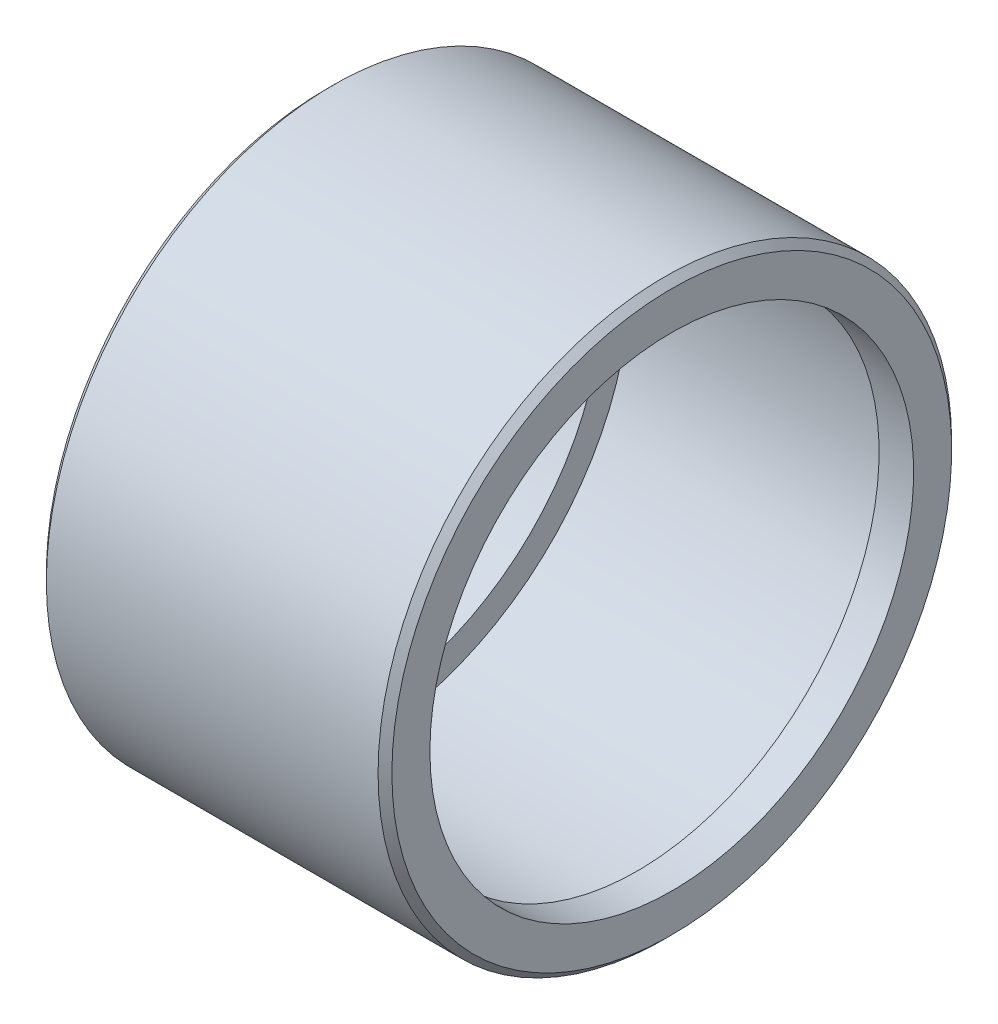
ISO-10303-21;
HEADER;
FILE_DESCRIPTION(('STEP AP214'),'2;1');
FILE_NAME('part.step','',(''),(''),'','','');
FILE_SCHEMA(('AUTOMOTIVE_DESIGN { 1 0 10303 214 1 1 1 1 }'));
ENDSEC;
DATA;
#1=APPLICATION_CONTEXT('core data for automotive mechanical design processes');
#2=APPLICATION_PROTOCOL_DEFINITION('international standard','automotive_design',2000,#1);
#3=PRODUCT_CONTEXT('',#1,'mechanical');
#4=PRODUCT('Part','Part','',(#3));
#5=PRODUCT_RELATED_PRODUCT_CATEGORY('part','',(#4));
#6=PRODUCT_DEFINITION_FORMATION('','',#4);
#7=PRODUCT_DEFINITION_CONTEXT('part definition',#1,'design');
#8=PRODUCT_DEFINITION('design','',#6,#7);
#9=PRODUCT_DEFINITION_SHAPE('','',#8);
#10=(LENGTH_UNIT() NAMED_UNIT(*) SI_UNIT(.MILLI.,.METRE.));
#11=(NAMED_UNIT(*) PLANE_ANGLE_UNIT() SI_UNIT($,.RADIAN.));
#12=(NAMED_UNIT(*) SI_UNIT($,.STERADIAN.) SOLID_ANGLE_UNIT());
#13=UNCERTAINTY_MEASURE_WITH_UNIT(LENGTH_MEASURE(1.E-05),#10,'distance_accuracy_value','');
#14=(GEOMETRIC_REPRESENTATION_CONTEXT(3) GLOBAL_UNCERTAINTY_ASSIGNED_CONTEXT((#13)) GLOBAL_UNIT_ASSIGNED_CONTEXT((#10,
#11,#12)) REPRESENTATION_CONTEXT('',''));
#15=CARTESIAN_POINT('',(0.,0.,0.));
#16=DIRECTION('',(0.,0.,1.));
#17=DIRECTION('',(1.,0.,0.));
#18=AXIS2_PLACEMENT_3D('',#15,#16,#17);
#19=CARTESIAN_POINT('',(-4.55642736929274,0.,0.));
#20=DIRECTION('',(-1.,0.,0.));
#21=DIRECTION('',(0.,0.,1.));
#22=AXIS2_PLACEMENT_3D('',#19,#20,#21);
#23=CYLINDRICAL_SURFACE('',#22,4.15);
#24=CARTESIAN_POINT('',(4.9,0.,0.));
#25=DIRECTION('',(-1.,0.,0.));
#26=DIRECTION('',(0.,0.,1.));
#27=AXIS2_PLACEMENT_3D('',#24,#25,#26);
#28=CIRCLE('',#27,4.15);
#29=CARTESIAN_POINT('',(4.9,0.,4.15));
#30=VERTEX_POINT('',#29);
#31=EDGE_CURVE('E360',#30,#30,#28,.T.);
#32=ORIENTED_EDGE('',*,*,#31,.T.);
#33=EDGE_LOOP('',(#32));
#34=FACE_BOUND('',#33,.T.);
#35=CARTESIAN_POINT('',(0.100000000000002,0.,0.));
#36=DIRECTION('',(1.,0.,0.));
#37=DIRECTION('',(0.,0.,-1.));
#38=AXIS2_PLACEMENT_3D('',#35,#36,#37);
#39=CIRCLE('',#38,4.15);
#40=CARTESIAN_POINT('',(0.100000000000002,0.,-4.15));
#41=VERTEX_POINT('',#40);
#42=EDGE_CURVE('E364',#41,#41,#39,.T.);
#43=ORIENTED_EDGE('',*,*,#42,.T.);
#44=EDGE_LOOP('',(#43));
#45=FACE_BOUND('',#44,.T.);
#46=ADVANCED_FACE('F350',(#34,#45),#23,.T.);
#47=CARTESIAN_POINT('',(5.,4.15,0.));
#48=DIRECTION('',(-1.,0.,0.));
#49=DIRECTION('',(0.,0.,1.));
#50=AXIS2_PLACEMENT_3D('',#47,#48,#49);
#51=PLANE('',#50);
#52=CARTESIAN_POINT('',(5.,0.,0.));
#53=DIRECTION('',(-1.,0.,0.));
#54=DIRECTION('',(0.,0.,1.));
#55=AXIS2_PLACEMENT_3D('',#52,#53,#54);
#56=CIRCLE('',#55,4.05);
#57=CARTESIAN_POINT('',(5.,0.,4.05));
#58=VERTEX_POINT('',#57);
#59=EDGE_CURVE('E356',#58,#58,#56,.F.);
#60=ORIENTED_EDGE('',*,*,#59,.T.);
#61=EDGE_LOOP('',(#60));
#62=FACE_BOUND('',#61,.T.);
#63=CARTESIAN_POINT('',(5.,0.,0.));
#64=DIRECTION('',(-1.,0.,0.));
#65=DIRECTION('',(0.,0.,1.));
#66=AXIS2_PLACEMENT_3D('',#63,#64,#65);
#67=CIRCLE('',#66,3.5);
#68=CARTESIAN_POINT('',(5.,0.,3.5));
#69=VERTEX_POINT('',#68);
#70=EDGE_CURVE('E369',#69,#69,#67,.T.);
#71=ORIENTED_EDGE('',*,*,#70,.T.);
#72=EDGE_LOOP('',(#71));
#73=FACE_BOUND('',#72,.T.);
#74=ADVANCED_FACE('F406',(#62,#73),#51,.F.);
#75=CARTESIAN_POINT('',(-4.55642736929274,0.,0.));
#76=DIRECTION('',(-1.,0.,0.));
#77=DIRECTION('',(0.,0.,1.));
#78=AXIS2_PLACEMENT_3D('',#75,#76,#77);
#79=CYLINDRICAL_SURFACE('',#78,3.5);
#80=ORIENTED_EDGE('',*,*,#70,.F.);
#81=EDGE_LOOP('',(#80));
#82=FACE_BOUND('',#81,.T.);
#83=CARTESIAN_POINT('',(4.5,0.,0.));
#84=DIRECTION('',(-1.,0.,0.));
#85=DIRECTION('',(0.,0.,1.));
#86=AXIS2_PLACEMENT_3D('',#83,#84,#85);
#87=CIRCLE('',#86,3.5);
#88=CARTESIAN_POINT('',(4.5,0.,3.5));
#89=VERTEX_POINT('',#88);
#90=EDGE_CURVE('E372',#89,#89,#87,.T.);
#91=ORIENTED_EDGE('',*,*,#90,.T.);
#92=EDGE_LOOP('',(#91));
#93=FACE_BOUND('',#92,.T.);
#94=ADVANCED_FACE('F410',(#82,#93),#79,.F.);
#95=CARTESIAN_POINT('',(4.5,3.9,0.));
#96=DIRECTION('',(1.,0.,0.));
#97=DIRECTION('',(0.,0.,-1.));
#98=AXIS2_PLACEMENT_3D('',#95,#96,#97);
#99=PLANE('',#98);
#100=ORIENTED_EDGE('',*,*,#90,.F.);
#101=EDGE_LOOP('',(#100));
#102=FACE_BOUND('',#101,.T.);
#103=CARTESIAN_POINT('',(4.5,0.,0.));
#104=DIRECTION('',(-1.,0.,0.));
#105=DIRECTION('',(0.,0.,1.));
#106=AXIS2_PLACEMENT_3D('',#103,#104,#105);
#107=CIRCLE('',#106,3.9);
#108=CARTESIAN_POINT('',(4.5,0.,3.9));
#109=VERTEX_POINT('',#108);
#110=EDGE_CURVE('E375',#109,#109,#107,.T.);
#111=ORIENTED_EDGE('',*,*,#110,.T.);
#112=EDGE_LOOP('',(#111));
#113=FACE_BOUND('',#112,.T.);
#114=ADVANCED_FACE('F445',(#102,#113),#99,.F.);
#115=CARTESIAN_POINT('',(-4.55642736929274,0.,0.));
#116=DIRECTION('',(-1.,0.,0.));
#117=DIRECTION('',(0.,0.,1.));
#118=AXIS2_PLACEMENT_3D('',#115,#116,#117);
#119=CYLINDRICAL_SURFACE('',#118,3.9);
#120=ORIENTED_EDGE('',*,*,#110,.F.);
#121=EDGE_LOOP('',(#120));
#122=FACE_BOUND('',#121,.T.);
#123=CARTESIAN_POINT('',(0.5,0.,0.));
#124=DIRECTION('',(-1.,0.,0.));
#125=DIRECTION('',(0.,0.,1.));
#126=AXIS2_PLACEMENT_3D('',#123,#124,#125);
#127=CIRCLE('',#126,3.9);
#128=CARTESIAN_POINT('',(0.5,0.,3.9));
#129=VERTEX_POINT('',#128);
#130=EDGE_CURVE('E378',#129,#129,#127,.T.);
#131=ORIENTED_EDGE('',*,*,#130,.T.);
#132=EDGE_LOOP('',(#131));
#133=FACE_BOUND('',#132,.T.);
#134=ADVANCED_FACE('F437',(#122,#133),#119,.F.);
#135=CARTESIAN_POINT('',(0.499999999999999,3.5,0.));
#136=DIRECTION('',(-1.,0.,0.));
#137=DIRECTION('',(0.,0.,1.));
#138=AXIS2_PLACEMENT_3D('',#135,#136,#137);
#139=PLANE('',#138);
#140=ORIENTED_EDGE('',*,*,#130,.F.);
#141=EDGE_LOOP('',(#140));
#142=FACE_BOUND('',#141,.T.);
#143=CARTESIAN_POINT('',(0.499999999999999,0.,0.));
#144=DIRECTION('',(-1.,0.,0.));
#145=DIRECTION('',(0.,0.,1.));
#146=AXIS2_PLACEMENT_3D('',#143,#144,#145);
#147=CIRCLE('',#146,3.5);
#148=CARTESIAN_POINT('',(0.499999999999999,0.,3.5));
#149=VERTEX_POINT('',#148);
#150=EDGE_CURVE('E381',#149,#149,#147,.T.);
#151=ORIENTED_EDGE('',*,*,#150,.T.);
#152=EDGE_LOOP('',(#151));
#153=FACE_BOUND('',#152,.T.);
#154=ADVANCED_FACE('F402',(#142,#153),#139,.F.);
#155=CARTESIAN_POINT('',(-4.55642736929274,0.,0.));
#156=DIRECTION('',(-1.,0.,0.));
#157=DIRECTION('',(0.,0.,1.));
#158=AXIS2_PLACEMENT_3D('',#155,#156,#157);
#159=CYLINDRICAL_SURFACE('',#158,3.5);
#160=ORIENTED_EDGE('',*,*,#150,.F.);
#161=EDGE_LOOP('',(#160));
#162=FACE_BOUND('',#161,.T.);
#163=CARTESIAN_POINT('',(0.,0.,0.));
#164=DIRECTION('',(-1.,0.,0.));
#165=DIRECTION('',(0.,0.,1.));
#166=AXIS2_PLACEMENT_3D('',#163,#164,#165);
#167=CIRCLE('',#166,3.5);
#168=CARTESIAN_POINT('',(0.,0.,3.5));
#169=VERTEX_POINT('',#168);
#170=EDGE_CURVE('E384',#169,#169,#167,.T.);
#171=ORIENTED_EDGE('',*,*,#170,.T.);
#172=EDGE_LOOP('',(#171));
#173=FACE_BOUND('',#172,.T.);
#174=ADVANCED_FACE('F388',(#162,#173),#159,.F.);
#175=CARTESIAN_POINT('',(0.,3.5,0.));
#176=DIRECTION('',(1.,0.,0.));
#177=DIRECTION('',(0.,0.,-1.));
#178=AXIS2_PLACEMENT_3D('',#175,#176,#177);
#179=PLANE('',#178);
#180=CARTESIAN_POINT('',(0.,0.,0.));
#181=DIRECTION('',(1.,0.,0.));
#182=DIRECTION('',(0.,0.,-1.));
#183=AXIS2_PLACEMENT_3D('',#180,#181,#182);
#184=CIRCLE('',#183,4.05);
#185=CARTESIAN_POINT('',(0.,0.,-4.05));
#186=VERTEX_POINT('',#185);
#187=EDGE_CURVE('E10',#186,#186,#184,.F.);
#188=ORIENTED_EDGE('',*,*,#187,.T.);
#189=EDGE_LOOP('',(#188));
#190=FACE_BOUND('',#189,.T.);
#191=ORIENTED_EDGE('',*,*,#170,.F.);
#192=EDGE_LOOP('',(#191));
#193=FACE_BOUND('',#192,.T.);
#194=ADVANCED_FACE('F390',(#190,#193),#179,.F.);
#195=CARTESIAN_POINT('',(4.9,0.,0.));
#196=DIRECTION('',(-1.,0.,0.));
#197=DIRECTION('',(0.,0.,1.));
#198=AXIS2_PLACEMENT_3D('',#195,#196,#197);
#199=CONICAL_SURFACE('',#198,4.15,0.785398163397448);
#200=ORIENTED_EDGE('',*,*,#59,.F.);
#201=EDGE_LOOP('',(#200));
#202=FACE_BOUND('',#201,.T.);
#203=ORIENTED_EDGE('',*,*,#31,.F.);
#204=EDGE_LOOP('',(#203));
#205=FACE_BOUND('',#204,.T.);
#206=ADVANCED_FACE('F392',(#202,#205),#199,.T.);
#207=CARTESIAN_POINT('',(0.,0.,0.));
#208=DIRECTION('',(1.,0.,0.));
#209=DIRECTION('',(0.,0.,-1.));
#210=AXIS2_PLACEMENT_3D('',#207,#208,#209);
#211=CONICAL_SURFACE('',#210,4.05,0.785398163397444);
#212=ORIENTED_EDGE('',*,*,#42,.F.);
#213=EDGE_LOOP('',(#212));
#214=FACE_BOUND('',#213,.T.);
#215=ORIENTED_EDGE('',*,*,#187,.F.);
#216=EDGE_LOOP('',(#215));
#217=FACE_BOUND('',#216,.T.);
#218=ADVANCED_FACE('F398',(#214,#217),#211,.T.);
#219=CLOSED_SHELL('',(#46,#74,#94,#114,#134,#154,#174,#194,#206,#218));
#220=MANIFOLD_SOLID_BREP('B2',#219);
#221=ADVANCED_BREP_SHAPE_REPRESENTATION('',(#18,#220),#14);
#222=SHAPE_DEFINITION_REPRESENTATION(#9,#221);
ENDSEC;
END-ISO-10303-21;
